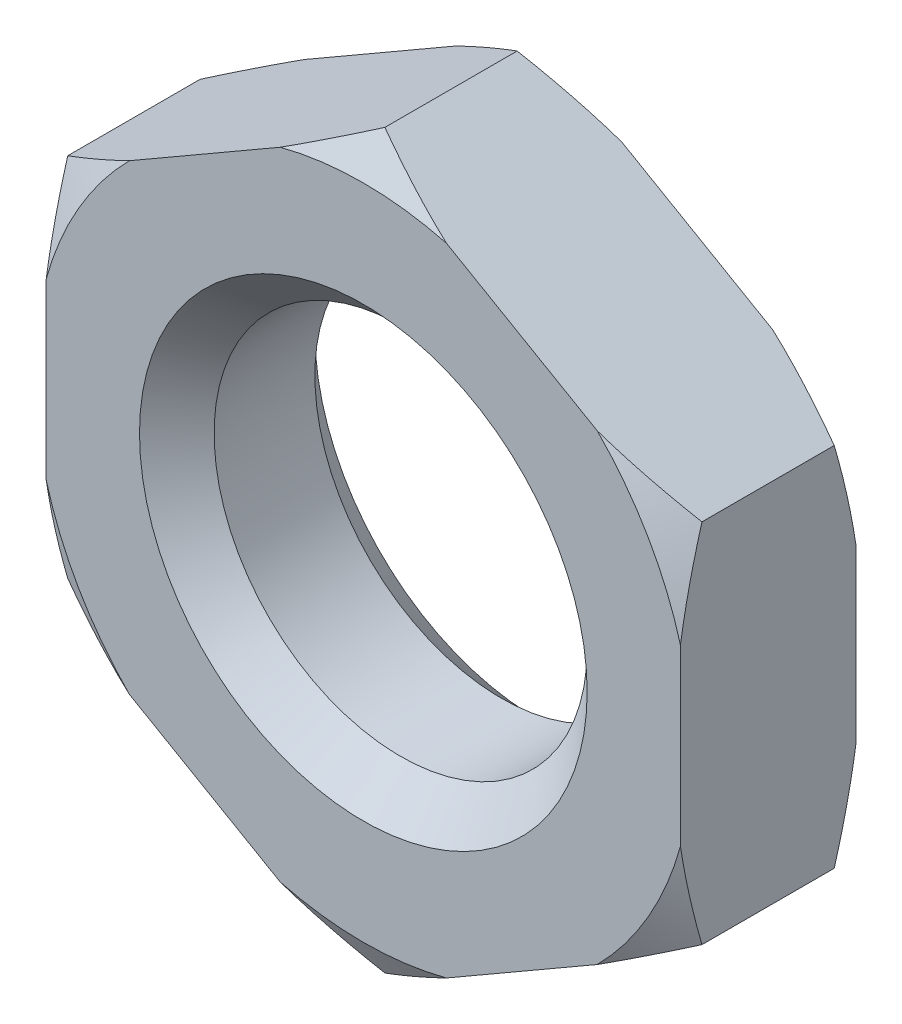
from build123d import *

# Parameters (mm, degrees)
SKETCH1_R           = 5
BOSS_EXTRUDE1_DEPTH = 2.35
CHAMFER1_SIZE       = 1


with BuildPart() as part:
    # Sketch1 → Boss-Extrude1 (new, symmetric)
    with BuildSketch(Plane.XY):
        Polygon((0, 9.814954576), (-8.5, 4.907477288), (-8.5, -4.907477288), (0, -9.814954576), (8.5, -4.907477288), (8.5, 4.907477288), align=None)
        Circle(SKETCH1_R, mode=Mode.SUBTRACT)
    extrude(amount=BOSS_EXTRUDE1_DEPTH, both=True)

    # Sketch3 → Cut-Revolve1 (revolve, cut)
    with BuildSketch(Plane(origin=(0, 0, 0), x_dir=(0, 0, -1), z_dir=(1, 0, 0))):
        Polygon((-2.35, 9.814954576), (-2.35, 8.814954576), (-1.772649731, 9.814954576), align=None)
    cut_revolve1 = revolve(axis=Axis((0, 0, -7.477018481), (0, 0, 1)), mode=Mode.SUBTRACT)

    # Mirror1: Cut-Revolve1 across plane
    add(cut_revolve1.mirror(Plane.XY), mode=Mode.SUBTRACT)

    # Chamfer1
    chamfer1_edges = [part.edges().sort_by_distance(p)[0] for p in [
        (-5, 0, -2.35),
        (-5, 0, 2.35),
    ]]
    chamfer(chamfer1_edges, length=CHAMFER1_SIZE)


solid = part.part
